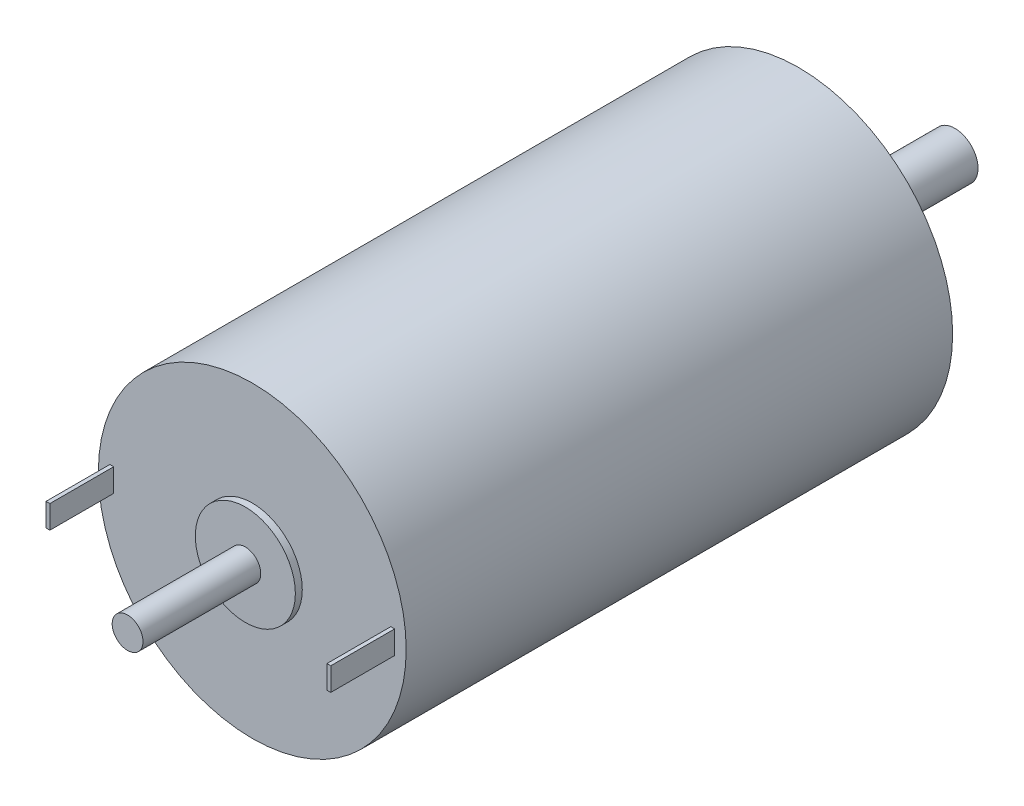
from build123d import *

# Parameters (mm, degrees)
SKETCH1_R          = 20
BODY_DEPTH         = 71
SKETCH2_R          = 6.5
EXTRUDE2_DEPTH     = 0.9
SKETCH3_R          = 2
TACH_SHAFT_DEPTH   = 15.3
SKETCH4_W          = 0.5
SKETCH4_H          = 3
WIRE_TABS_DEPTH    = 8.3
SKETCH5_R          = 8
EXTRUDE5_DEPTH     = 1.4
SKETCH6_R          = 4
EXTRUDE6_DEPTH     = 2.1
SKETCH7_R          = 3
OUTPUT_SHAFT_DEPTH = 20.3
SKETCH8_R          = 1.5
OUTPUT_BCD_DEPTH   = 5


with BuildPart() as part:
    # Sketch1 → body (new body)
    with BuildSketch(Plane.XY):
        Circle(SKETCH1_R)
    extrude(amount=BODY_DEPTH)

    # Sketch2 → Extrude2 (add)
    with BuildSketch(Plane.XY.offset(71)):
        Circle(SKETCH2_R)
    extrude(amount=EXTRUDE2_DEPTH)

    # Sketch3 → tach_shaft (add)
    with BuildSketch(Plane.XY.offset(71.9)):
        Circle(SKETCH3_R)
    extrude(amount=TACH_SHAFT_DEPTH)

    # Sketch4 → wire_tabs (add)
    with BuildSketch(Plane.XY.offset(71)):
        with Locations((-18.25, 0.082698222)):
            Rectangle(SKETCH4_W, SKETCH4_H)
        with Locations((18.25, 0.082698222)):
            Rectangle(SKETCH4_W, SKETCH4_H)
    extrude(amount=WIRE_TABS_DEPTH)

    # Sketch5 → Extrude5 (add)
    with BuildSketch(Plane(origin=(0, 0, 0), x_dir=(-1, 0, 0), z_dir=(0, 0, -1))):
        with Locations(Location((0, 0, 0), (0, 0, 180))):
            Circle(SKETCH5_R)
    extrude(amount=EXTRUDE5_DEPTH)

    # Sketch6 → Extrude6 (add)
    with BuildSketch(Plane(origin=(0, 0, -1.4), x_dir=(-1, 0, 0), z_dir=(0, 0, -1))):
        Circle(SKETCH6_R)
    extrude(amount=EXTRUDE6_DEPTH)

    # Sketch7 → output_shaft (add)
    with BuildSketch(Plane(origin=(0, 0, 0), x_dir=(-1, 0, 0), z_dir=(0, 0, -1))):
        Circle(SKETCH7_R)
    extrude(amount=OUTPUT_SHAFT_DEPTH)

    # Sketch8 → output_bcd (cut)
    with BuildSketch(Plane(origin=(0, 0, 0), x_dir=(-1, 0, 0), z_dir=(0, 0, -1))):
        with Locations((11, 0)):
            Circle(SKETCH8_R)
        with Locations((5.5, -9.526279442)):
            Circle(SKETCH8_R)
        with Locations((-5.5, -9.526279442)):
            Circle(SKETCH8_R)
        with Locations((-11, 0)):
            Circle(SKETCH8_R)
        with Locations((-5.5, 9.526279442)):
            Circle(SKETCH8_R)
        with Locations((5.5, 9.526279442)):
            Circle(SKETCH8_R)
    extrude(amount=-OUTPUT_BCD_DEPTH, mode=Mode.SUBTRACT)


solid = part.part
